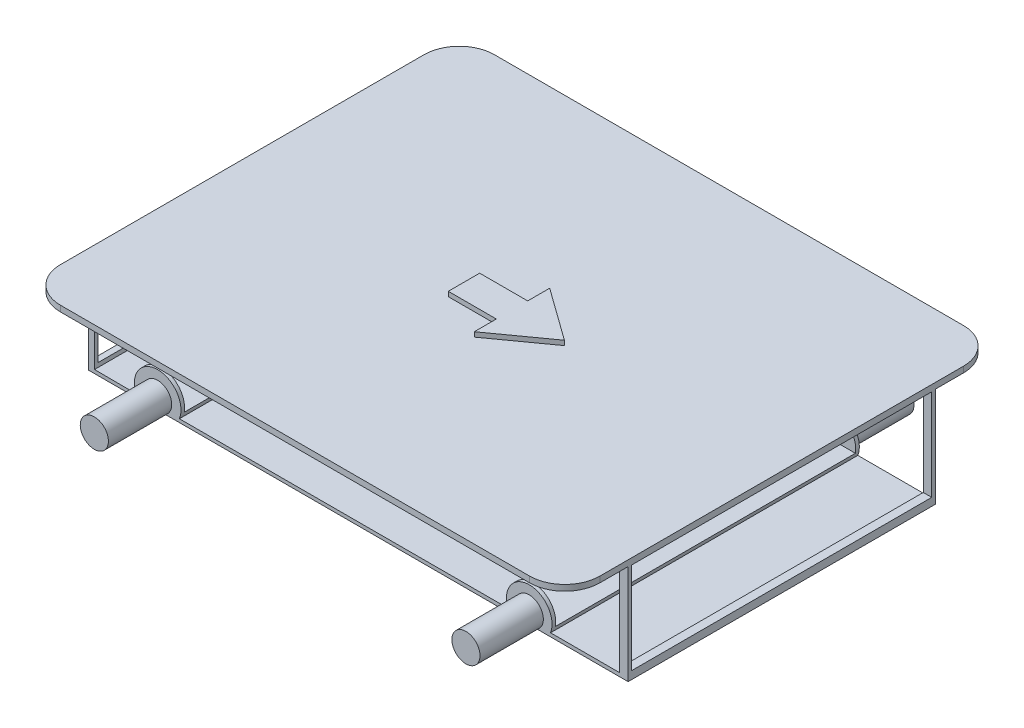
from build123d import *

# Parameters (mm, degrees)
SKETCH1_W           = 230
SKETCH1_H           = 185
BOSS_EXTRUDE1_DEPTH = 45
SKETCH3_W           = 230
SKETCH3_H           = 42.5
CUT_EXTRUDE1_DEPTH  = 27
SKETCH4_R           = 6
BOSS_EXTRUDE3_DEPTH = 27
BOSS_EXTRUDE4_DEPTH = 2
CUT_EXTRUDE2_DEPTH  = 201.992537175
SKETCH7_W           = 127.894203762
SKETCH7_H           = 38.993599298
CUT_EXTRUDE3_DEPTH  = 253.319737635
FILLET1_R           = 15


with BuildPart() as part:
    # Sketch1 → Boss-Extrude1 (new body)
    with BuildSketch(Plane(origin=(0, 0, 0), x_dir=(1, 0, 0), z_dir=(0, 1, 0))):
        Rectangle(SKETCH1_W, SKETCH1_H)
    extrude(amount=BOSS_EXTRUDE1_DEPTH)

    # Sketch3 → Cut-Extrude1 (cut)
    with BuildSketch(Plane.XY.offset(92.5)):
        with Locations((0, 21.25)):
            Rectangle(SKETCH3_W, SKETCH3_H)
    cut_extrude1 = extrude(amount=-CUT_EXTRUDE1_DEPTH, mode=Mode.SUBTRACT)

    # Mirror1: Cut-Extrude1 across plane
    add(cut_extrude1.mirror(Plane.XY), mode=Mode.SUBTRACT)

    # Sketch4 → Boss-Extrude3 (add)
    with BuildSketch(Plane.XY.offset(65.5)):
        with Locations(Location((-85.578525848, 5, 0), (0, 0, 236.442690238))):
            Circle(SKETCH4_R)
        with Locations(Location((72.863707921, 5, 0), (0, 0, 236.442690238))):
            Circle(SKETCH4_R)
    boss_extrude3 = extrude(amount=BOSS_EXTRUDE3_DEPTH)

    # Mirror2: Boss-Extrude3 across plane
    add(boss_extrude3.mirror(Plane.XY))

    # Sketch5 → Boss-Extrude4 (add)
    with BuildSketch(Plane(origin=(0, 45, 0), x_dir=(1, 0, 0), z_dir=(0, 1, 0))):
        Polygon((-20.47282932, 6.686096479), (-20.47282932, 0), (22.348578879, 0), (0, 16.063047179), (0, 6.686096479), align=None)
        Polygon((-20.47282932, 0), (-20.47282932, -6.686096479), (0, -6.686096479), (0, -16.063047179), (22.348578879, 0), align=None)
    extrude(amount=BOSS_EXTRUDE4_DEPTH)

    # Sketch6 → Cut-Extrude2 (cut, through all)
    with BuildSketch(Plane.XY.offset(65.5)):
        with BuildLine():
            Line((-112.483753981, 1.521128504), (-112.483753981, 40.927458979))
            Line((-112.483753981, 40.927458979), (111.392309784, 40.927458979))
            Line((111.392309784, 40.927458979), (111.392309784, 1.521128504))
            Line((111.392309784, 1.521128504), (81.94130629, 1.521128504))
            ThreePointArc((81.94130629, 1.521128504), (72.863707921, 14.721385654), (63.786109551, 1.521128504))
            Line((63.786109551, 1.521128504), (-76.307998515, 1.426672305))
            ThreePointArc((-76.307998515, 1.426672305), (-85.578525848, 14.935358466), (-94.849053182, 1.426672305))
            Line((-94.849053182, 1.426672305), (-112.483753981, 1.521128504))
        make_face()
    extrude(amount=-CUT_EXTRUDE2_DEPTH, mode=Mode.SUBTRACT)

    # Sketch7 → Cut-Extrude3 (cut, through all)
    with BuildSketch(Plane.ZY.offset(115)):
        with Locations((0, 22.825746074)):
            Rectangle(SKETCH7_W, SKETCH7_H)
    extrude(amount=-CUT_EXTRUDE3_DEPTH, mode=Mode.SUBTRACT)

    # Fillet1
    fillet1_edges = [part.edges().sort_by_distance(p)[0] for p in [
        (115, 43.75, 92.5),
        (-115, 43.75, 92.5),
        (-115, 43.75, -92.5),
        (115, 43.75, -92.5),
    ]]
    fillet(fillet1_edges, radius=FILLET1_R)


solid = part.part
